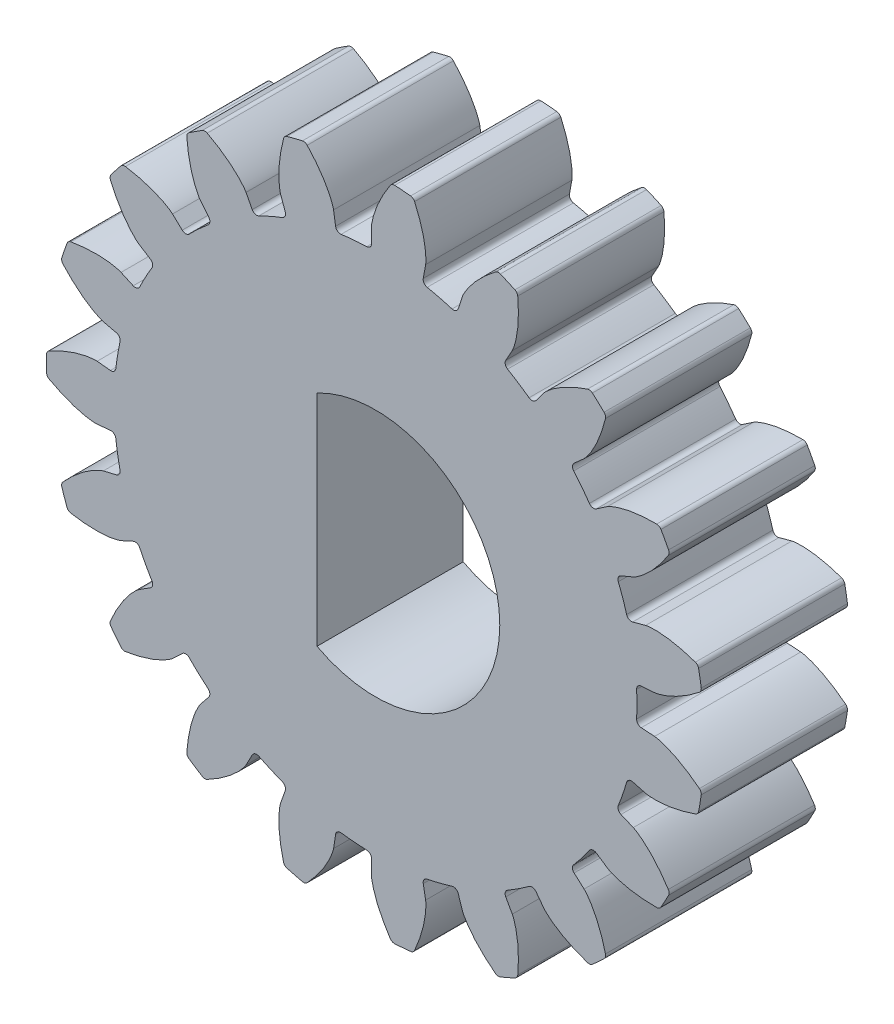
from build123d import *

# Parameters (mm, degrees)
SKETCH10_R                = 22.5
SKETCH10_R_2              = 1.25
BOSS_EXTRUDE5_DEPTH       = 10
CUT_EXTRUDE1_DEPTH        = 34.35416016
FILLET1_R                 = 0.34
CIRPATTERN1_COUNT         = 19
CIRPATTERN1_COPY_1_DEPTH  = 34.35416016
CIRPATTERN1_COPY_2_DEPTH  = 34.35416016
CIRPATTERN1_COPY_3_DEPTH  = 34.35416016
CIRPATTERN1_COPY_4_DEPTH  = 34.35416016
CIRPATTERN1_COPY_5_DEPTH  = 34.35416016
CIRPATTERN1_COPY_6_DEPTH  = 34.35416016
CIRPATTERN1_COPY_7_DEPTH  = 34.35416016
CIRPATTERN1_COPY_8_DEPTH  = 34.35416016
CIRPATTERN1_COPY_9_DEPTH  = 34.35416016
CIRPATTERN1_COPY_10_DEPTH = 34.35416016
CIRPATTERN1_COPY_11_DEPTH = 34.35416016
CIRPATTERN1_COPY_12_DEPTH = 34.35416016
CIRPATTERN1_COPY_13_DEPTH = 34.35416016
CIRPATTERN1_COPY_14_DEPTH = 34.35416016
CIRPATTERN1_COPY_15_DEPTH = 34.35416016
CIRPATTERN1_COPY_16_DEPTH = 34.35416016
CIRPATTERN1_COPY_17_DEPTH = 34.35416016
CIRPATTERN1_COPY_18_DEPTH = 34.35416016
FILLET1_OF_CIRPATTERN1_R  = 0.34
CUT_EXTRUDE2_DEPTH        = 34.328614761


with BuildPart() as part:
    # Sketch10 → Boss-Extrude5 (new body)
    with BuildSketch(Plane.XY):
        Circle(SKETCH10_R)
        Circle(SKETCH10_R_2, mode=Mode.SUBTRACT)
    extrude(amount=BOSS_EXTRUDE5_DEPTH)

    # Sketch11 → Cut-Extrude1 (cut, through all)
    with BuildSketch(Plane.XY.offset(10)):
        with BuildLine():
            Line((17.88, 0), (22.500466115, 0))
            ThreePointArc((22.500466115, 0), (22.451062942, 1.490217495), (22.303070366, 2.973890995))
            add(Edge.make_bspline(
                [(19.085941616, 1.295420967), (19.091347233, 1.295859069), (19.106491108, 1.297307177), (19.135048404, 1.300910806), (19.181520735, 1.308018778), (19.240530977, 1.318877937), (19.316536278, 1.334978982), (19.40569711, 1.356597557), (19.503249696, 1.383126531), (19.608873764, 1.414970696), (19.713766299, 1.449369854), (19.817921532, 1.486125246), (19.921223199, 1.524936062), (20.045785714, 1.574535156), (20.194335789, 1.637599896), (20.366697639, 1.716517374), (20.56061638, 1.812144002), (20.756460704, 1.916106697), (20.947660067, 2.023736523), (21.138990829, 2.138563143), (21.322794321, 2.253970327), (21.511680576, 2.380010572), (21.685008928, 2.499494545), (21.876829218, 2.640122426), (22.030947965, 2.755590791), (22.188094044, 2.880463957), (22.264270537, 2.942063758), (22.303070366, 2.973890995)],
                knots=[0, 0, 0, 0, 0, 0.005376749, 0.015083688, 0.02853182, 0.04661014, 0.064854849, 0.092110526, 0.119476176, 0.146842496, 0.174208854, 0.201574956, 0.228941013, 0.256307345, 0.307035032, 0.361767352, 0.416499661, 0.471231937, 0.525964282, 0.580696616, 0.635428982, 0.690161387, 0.744893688, 0.799626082, 0.854358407, 0.909090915, 0.909090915, 0.909090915, 0.909090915, 0.909090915], degree=4))
            Line((19.085941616, 1.295420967), (17.838957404, 1.210784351))
            ThreePointArc((17.838957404, 1.210784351), (17.869736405, 0.605739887), (17.88, 0))
        make_face()
    cut_extrude1 = extrude(amount=-CUT_EXTRUDE1_DEPTH, mode=Mode.SUBTRACT)

    # Mirror1: Cut-Extrude1 across plane
    add(cut_extrude1.mirror(Plane(origin=(17.88, 0, 0), x_dir=(0, 0, 1), z_dir=(0, -1, 0))), mode=Mode.SUBTRACT)

    # Fillet1
    fillet1_edges = [part.edges().sort_by_distance(p)[0] for p in [
        (17.838957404, -1.210784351, 5),
        (22.302646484, -2.973543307, 5),
        (22.302646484, 2.973543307, 5),
        (17.838957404, 1.210784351, 5),
    ]]
    fillet(fillet1_edges, radius=FILLET1_R)

    # CirPattern1: Cut-Extrude1 ×19 about axis
    cirpattern1_axis = Axis((0, 0, 10), (0, 0, -1))
    for i in range(1, CIRPATTERN1_COUNT):
        add(cut_extrude1.rotate(cirpattern1_axis, i * 360 / CIRPATTERN1_COUNT), mode=Mode.SUBTRACT)

    # CirPattern1 copy 1 sketch → CirPattern1 copy 1 (cut, through all)
    with BuildSketch(Plane(origin=(0, 0, 10), x_dir=(0.9458172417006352, -0.3246994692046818, 0), z_dir=(0, 0, 1))):
        with BuildLine():
            Line((17.88, 0), (22.500466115, 0))
            ThreePointArc((22.500466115, 0), (22.451062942, -1.490217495), (22.303070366, -2.973890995))
            add(Edge.make_bspline(
                [(19.085941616, -1.295420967), (19.091347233, -1.295859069), (19.106491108, -1.297307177), (19.135048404, -1.300910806), (19.181520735, -1.308018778), (19.240530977, -1.318877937), (19.316536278, -1.334978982), (19.40569711, -1.356597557), (19.503249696, -1.383126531), (19.608873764, -1.414970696), (19.713766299, -1.449369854), (19.817921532, -1.486125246), (19.921223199, -1.524936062), (20.045785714, -1.574535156), (20.194335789, -1.637599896), (20.366697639, -1.716517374), (20.56061638, -1.812144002), (20.756460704, -1.916106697), (20.947660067, -2.023736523), (21.138990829, -2.138563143), (21.322794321, -2.253970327), (21.511680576, -2.380010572), (21.685008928, -2.499494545), (21.876829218, -2.640122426), (22.030947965, -2.755590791), (22.188094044, -2.880463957), (22.264270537, -2.942063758), (22.303070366, -2.973890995)],
                knots=[0, 0, 0, 0, 0, 0.005376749, 0.015083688, 0.02853182, 0.04661014, 0.064854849, 0.092110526, 0.119476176, 0.146842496, 0.174208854, 0.201574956, 0.228941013, 0.256307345, 0.307035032, 0.361767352, 0.416499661, 0.471231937, 0.525964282, 0.580696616, 0.635428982, 0.690161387, 0.744893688, 0.799626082, 0.854358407, 0.909090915, 0.909090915, 0.909090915, 0.909090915, 0.909090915], degree=4))
            Line((19.085941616, -1.295420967), (17.838957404, -1.210784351))
            ThreePointArc((17.838957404, -1.210784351), (17.869736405, -0.605739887), (17.88, 0))
        make_face()
    extrude(amount=-CIRPATTERN1_COPY_1_DEPTH, mode=Mode.SUBTRACT)

    # CirPattern1 copy 2 sketch → CirPattern1 copy 2 (cut, through all)
    with BuildSketch(Plane(origin=(0, 0, 10), x_dir=(0.7891405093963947, -0.6142127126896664, 0), z_dir=(0, 0, 1))):
        with BuildLine():
            Line((17.88, 0), (22.500466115, 0))
            ThreePointArc((22.500466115, 0), (22.451062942, -1.490217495), (22.303070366, -2.973890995))
            add(Edge.make_bspline(
                [(19.085941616, -1.295420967), (19.091347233, -1.295859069), (19.106491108, -1.297307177), (19.135048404, -1.300910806), (19.181520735, -1.308018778), (19.240530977, -1.318877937), (19.316536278, -1.334978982), (19.40569711, -1.356597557), (19.503249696, -1.383126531), (19.608873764, -1.414970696), (19.713766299, -1.449369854), (19.817921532, -1.486125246), (19.921223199, -1.524936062), (20.045785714, -1.574535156), (20.194335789, -1.637599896), (20.366697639, -1.716517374), (20.56061638, -1.812144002), (20.756460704, -1.916106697), (20.947660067, -2.023736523), (21.138990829, -2.138563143), (21.322794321, -2.253970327), (21.511680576, -2.380010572), (21.685008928, -2.499494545), (21.876829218, -2.640122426), (22.030947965, -2.755590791), (22.188094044, -2.880463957), (22.264270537, -2.942063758), (22.303070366, -2.973890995)],
                knots=[0, 0, 0, 0, 0, 0.005376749, 0.015083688, 0.02853182, 0.04661014, 0.064854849, 0.092110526, 0.119476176, 0.146842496, 0.174208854, 0.201574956, 0.228941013, 0.256307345, 0.307035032, 0.361767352, 0.416499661, 0.471231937, 0.525964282, 0.580696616, 0.635428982, 0.690161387, 0.744893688, 0.799626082, 0.854358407, 0.909090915, 0.909090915, 0.909090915, 0.909090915, 0.909090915], degree=4))
            Line((19.085941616, -1.295420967), (17.838957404, -1.210784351))
            ThreePointArc((17.838957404, -1.210784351), (17.869736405, -0.605739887), (17.88, 0))
        make_face()
    extrude(amount=-CIRPATTERN1_COPY_2_DEPTH, mode=Mode.SUBTRACT)

    # CirPattern1 copy 3 sketch → CirPattern1 copy 3 (cut, through all)
    with BuildSketch(Plane(origin=(0, 0, 10), x_dir=(0.5469481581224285, -0.8371664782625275, 0), z_dir=(0, 0, 1))):
        with BuildLine():
            Line((17.88, 0), (22.500466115, 0))
            ThreePointArc((22.500466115, 0), (22.451062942, -1.490217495), (22.303070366, -2.973890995))
            add(Edge.make_bspline(
                [(19.085941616, -1.295420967), (19.091347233, -1.295859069), (19.106491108, -1.297307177), (19.135048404, -1.300910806), (19.181520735, -1.308018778), (19.240530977, -1.318877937), (19.316536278, -1.334978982), (19.40569711, -1.356597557), (19.503249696, -1.383126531), (19.608873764, -1.414970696), (19.713766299, -1.449369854), (19.817921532, -1.486125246), (19.921223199, -1.524936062), (20.045785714, -1.574535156), (20.194335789, -1.637599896), (20.366697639, -1.716517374), (20.56061638, -1.812144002), (20.756460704, -1.916106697), (20.947660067, -2.023736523), (21.138990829, -2.138563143), (21.322794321, -2.253970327), (21.511680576, -2.380010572), (21.685008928, -2.499494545), (21.876829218, -2.640122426), (22.030947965, -2.755590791), (22.188094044, -2.880463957), (22.264270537, -2.942063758), (22.303070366, -2.973890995)],
                knots=[0, 0, 0, 0, 0, 0.005376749, 0.015083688, 0.02853182, 0.04661014, 0.064854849, 0.092110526, 0.119476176, 0.146842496, 0.174208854, 0.201574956, 0.228941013, 0.256307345, 0.307035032, 0.361767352, 0.416499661, 0.471231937, 0.525964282, 0.580696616, 0.635428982, 0.690161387, 0.744893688, 0.799626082, 0.854358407, 0.909090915, 0.909090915, 0.909090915, 0.909090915, 0.909090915], degree=4))
            Line((19.085941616, -1.295420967), (17.838957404, -1.210784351))
            ThreePointArc((17.838957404, -1.210784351), (17.869736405, -0.605739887), (17.88, 0))
        make_face()
    extrude(amount=-CIRPATTERN1_COPY_3_DEPTH, mode=Mode.SUBTRACT)

    # CirPattern1 copy 4 sketch → CirPattern1 copy 4 (cut, through all)
    with BuildSketch(Plane(origin=(0, 0, 10), x_dir=(0.24548548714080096, -0.9694002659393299, 0), z_dir=(0, 0, 1))):
        with BuildLine():
            Line((17.88, 0), (22.500466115, 0))
            ThreePointArc((22.500466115, 0), (22.451062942, -1.490217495), (22.303070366, -2.973890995))
            add(Edge.make_bspline(
                [(19.085941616, -1.295420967), (19.091347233, -1.295859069), (19.106491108, -1.297307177), (19.135048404, -1.300910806), (19.181520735, -1.308018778), (19.240530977, -1.318877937), (19.316536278, -1.334978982), (19.40569711, -1.356597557), (19.503249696, -1.383126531), (19.608873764, -1.414970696), (19.713766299, -1.449369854), (19.817921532, -1.486125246), (19.921223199, -1.524936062), (20.045785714, -1.574535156), (20.194335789, -1.637599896), (20.366697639, -1.716517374), (20.56061638, -1.812144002), (20.756460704, -1.916106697), (20.947660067, -2.023736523), (21.138990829, -2.138563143), (21.322794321, -2.253970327), (21.511680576, -2.380010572), (21.685008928, -2.499494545), (21.876829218, -2.640122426), (22.030947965, -2.755590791), (22.188094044, -2.880463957), (22.264270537, -2.942063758), (22.303070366, -2.973890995)],
                knots=[0, 0, 0, 0, 0, 0.005376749, 0.015083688, 0.02853182, 0.04661014, 0.064854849, 0.092110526, 0.119476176, 0.146842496, 0.174208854, 0.201574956, 0.228941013, 0.256307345, 0.307035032, 0.361767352, 0.416499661, 0.471231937, 0.525964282, 0.580696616, 0.635428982, 0.690161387, 0.744893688, 0.799626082, 0.854358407, 0.909090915, 0.909090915, 0.909090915, 0.909090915, 0.909090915], degree=4))
            Line((19.085941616, -1.295420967), (17.838957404, -1.210784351))
            ThreePointArc((17.838957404, -1.210784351), (17.869736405, -0.605739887), (17.88, 0))
        make_face()
    extrude(amount=-CIRPATTERN1_COPY_4_DEPTH, mode=Mode.SUBTRACT)

    # CirPattern1 copy 5 sketch → CirPattern1 copy 5 (cut, through all)
    with BuildSketch(Plane(origin=(0, 0, 10), x_dir=(-0.08257934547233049, -0.99658449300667, 0), z_dir=(0, 0, 1))):
        with BuildLine():
            Line((17.88, 0), (22.500466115, 0))
            ThreePointArc((22.500466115, 0), (22.451062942, -1.490217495), (22.303070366, -2.973890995))
            add(Edge.make_bspline(
                [(19.085941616, -1.295420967), (19.091347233, -1.295859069), (19.106491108, -1.297307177), (19.135048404, -1.300910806), (19.181520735, -1.308018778), (19.240530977, -1.318877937), (19.316536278, -1.334978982), (19.40569711, -1.356597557), (19.503249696, -1.383126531), (19.608873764, -1.414970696), (19.713766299, -1.449369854), (19.817921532, -1.486125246), (19.921223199, -1.524936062), (20.045785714, -1.574535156), (20.194335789, -1.637599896), (20.366697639, -1.716517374), (20.56061638, -1.812144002), (20.756460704, -1.916106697), (20.947660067, -2.023736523), (21.138990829, -2.138563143), (21.322794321, -2.253970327), (21.511680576, -2.380010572), (21.685008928, -2.499494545), (21.876829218, -2.640122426), (22.030947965, -2.755590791), (22.188094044, -2.880463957), (22.264270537, -2.942063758), (22.303070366, -2.973890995)],
                knots=[0, 0, 0, 0, 0, 0.005376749, 0.015083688, 0.02853182, 0.04661014, 0.064854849, 0.092110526, 0.119476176, 0.146842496, 0.174208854, 0.201574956, 0.228941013, 0.256307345, 0.307035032, 0.361767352, 0.416499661, 0.471231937, 0.525964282, 0.580696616, 0.635428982, 0.690161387, 0.744893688, 0.799626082, 0.854358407, 0.909090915, 0.909090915, 0.909090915, 0.909090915, 0.909090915], degree=4))
            Line((19.085941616, -1.295420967), (17.838957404, -1.210784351))
            ThreePointArc((17.838957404, -1.210784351), (17.869736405, -0.605739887), (17.88, 0))
        make_face()
    extrude(amount=-CIRPATTERN1_COPY_5_DEPTH, mode=Mode.SUBTRACT)

    # CirPattern1 copy 6 sketch → CirPattern1 copy 6 (cut, through all)
    with BuildSketch(Plane(origin=(0, 0, 10), x_dir=(-0.4016954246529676, -0.9157733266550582, 0), z_dir=(0, 0, 1))):
        with BuildLine():
            Line((17.88, 0), (22.500466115, 0))
            ThreePointArc((22.500466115, 0), (22.451062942, -1.490217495), (22.303070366, -2.973890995))
            add(Edge.make_bspline(
                [(19.085941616, -1.295420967), (19.091347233, -1.295859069), (19.106491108, -1.297307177), (19.135048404, -1.300910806), (19.181520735, -1.308018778), (19.240530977, -1.318877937), (19.316536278, -1.334978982), (19.40569711, -1.356597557), (19.503249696, -1.383126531), (19.608873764, -1.414970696), (19.713766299, -1.449369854), (19.817921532, -1.486125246), (19.921223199, -1.524936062), (20.045785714, -1.574535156), (20.194335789, -1.637599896), (20.366697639, -1.716517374), (20.56061638, -1.812144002), (20.756460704, -1.916106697), (20.947660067, -2.023736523), (21.138990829, -2.138563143), (21.322794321, -2.253970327), (21.511680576, -2.380010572), (21.685008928, -2.499494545), (21.876829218, -2.640122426), (22.030947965, -2.755590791), (22.188094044, -2.880463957), (22.264270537, -2.942063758), (22.303070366, -2.973890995)],
                knots=[0, 0, 0, 0, 0, 0.005376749, 0.015083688, 0.02853182, 0.04661014, 0.064854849, 0.092110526, 0.119476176, 0.146842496, 0.174208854, 0.201574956, 0.228941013, 0.256307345, 0.307035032, 0.361767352, 0.416499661, 0.471231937, 0.525964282, 0.580696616, 0.635428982, 0.690161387, 0.744893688, 0.799626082, 0.854358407, 0.909090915, 0.909090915, 0.909090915, 0.909090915, 0.909090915], degree=4))
            Line((19.085941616, -1.295420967), (17.838957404, -1.210784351))
            ThreePointArc((17.838957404, -1.210784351), (17.869736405, -0.605739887), (17.88, 0))
        make_face()
    extrude(amount=-CIRPATTERN1_COPY_6_DEPTH, mode=Mode.SUBTRACT)

    # CirPattern1 copy 7 sketch → CirPattern1 copy 7 (cut, through all)
    with BuildSketch(Plane(origin=(0, 0, 10), x_dir=(-0.6772815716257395, -0.735723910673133, 0), z_dir=(0, 0, 1))):
        with BuildLine():
            Line((17.88, 0), (22.500466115, 0))
            ThreePointArc((22.500466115, 0), (22.451062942, -1.490217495), (22.303070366, -2.973890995))
            add(Edge.make_bspline(
                [(19.085941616, -1.295420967), (19.091347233, -1.295859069), (19.106491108, -1.297307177), (19.135048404, -1.300910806), (19.181520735, -1.308018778), (19.240530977, -1.318877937), (19.316536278, -1.334978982), (19.40569711, -1.356597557), (19.503249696, -1.383126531), (19.608873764, -1.414970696), (19.713766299, -1.449369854), (19.817921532, -1.486125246), (19.921223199, -1.524936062), (20.045785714, -1.574535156), (20.194335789, -1.637599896), (20.366697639, -1.716517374), (20.56061638, -1.812144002), (20.756460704, -1.916106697), (20.947660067, -2.023736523), (21.138990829, -2.138563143), (21.322794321, -2.253970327), (21.511680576, -2.380010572), (21.685008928, -2.499494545), (21.876829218, -2.640122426), (22.030947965, -2.755590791), (22.188094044, -2.880463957), (22.264270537, -2.942063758), (22.303070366, -2.973890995)],
                knots=[0, 0, 0, 0, 0, 0.005376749, 0.015083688, 0.02853182, 0.04661014, 0.064854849, 0.092110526, 0.119476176, 0.146842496, 0.174208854, 0.201574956, 0.228941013, 0.256307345, 0.307035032, 0.361767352, 0.416499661, 0.471231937, 0.525964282, 0.580696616, 0.635428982, 0.690161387, 0.744893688, 0.799626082, 0.854358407, 0.909090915, 0.909090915, 0.909090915, 0.909090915, 0.909090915], degree=4))
            Line((19.085941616, -1.295420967), (17.838957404, -1.210784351))
            ThreePointArc((17.838957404, -1.210784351), (17.869736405, -0.605739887), (17.88, 0))
        make_face()
    extrude(amount=-CIRPATTERN1_COPY_7_DEPTH, mode=Mode.SUBTRACT)

    # CirPattern1 copy 8 sketch → CirPattern1 copy 8 (cut, through all)
    with BuildSketch(Plane(origin=(0, 0, 10), x_dir=(-0.8794737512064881, -0.47594739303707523, 0), z_dir=(0, 0, 1))):
        with BuildLine():
            Line((17.88, 0), (22.500466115, 0))
            ThreePointArc((22.500466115, 0), (22.451062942, -1.490217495), (22.303070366, -2.973890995))
            add(Edge.make_bspline(
                [(19.085941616, -1.295420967), (19.091347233, -1.295859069), (19.106491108, -1.297307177), (19.135048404, -1.300910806), (19.181520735, -1.308018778), (19.240530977, -1.318877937), (19.316536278, -1.334978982), (19.40569711, -1.356597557), (19.503249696, -1.383126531), (19.608873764, -1.414970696), (19.713766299, -1.449369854), (19.817921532, -1.486125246), (19.921223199, -1.524936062), (20.045785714, -1.574535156), (20.194335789, -1.637599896), (20.366697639, -1.716517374), (20.56061638, -1.812144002), (20.756460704, -1.916106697), (20.947660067, -2.023736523), (21.138990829, -2.138563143), (21.322794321, -2.253970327), (21.511680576, -2.380010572), (21.685008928, -2.499494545), (21.876829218, -2.640122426), (22.030947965, -2.755590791), (22.188094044, -2.880463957), (22.264270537, -2.942063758), (22.303070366, -2.973890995)],
                knots=[0, 0, 0, 0, 0, 0.005376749, 0.015083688, 0.02853182, 0.04661014, 0.064854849, 0.092110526, 0.119476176, 0.146842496, 0.174208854, 0.201574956, 0.228941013, 0.256307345, 0.307035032, 0.361767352, 0.416499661, 0.471231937, 0.525964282, 0.580696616, 0.635428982, 0.690161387, 0.744893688, 0.799626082, 0.854358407, 0.909090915, 0.909090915, 0.909090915, 0.909090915, 0.909090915], degree=4))
            Line((19.085941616, -1.295420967), (17.838957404, -1.210784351))
            ThreePointArc((17.838957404, -1.210784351), (17.869736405, -0.605739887), (17.88, 0))
        make_face()
    extrude(amount=-CIRPATTERN1_COPY_8_DEPTH, mode=Mode.SUBTRACT)

    # CirPattern1 copy 9 sketch → CirPattern1 copy 9 (cut, through all)
    with BuildSketch(Plane(origin=(0, 0, 10), x_dir=(-0.986361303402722, -0.1645945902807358, 0), z_dir=(0, 0, 1))):
        with BuildLine():
            Line((17.88, 0), (22.500466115, 0))
            ThreePointArc((22.500466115, 0), (22.451062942, -1.490217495), (22.303070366, -2.973890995))
            add(Edge.make_bspline(
                [(19.085941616, -1.295420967), (19.091347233, -1.295859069), (19.106491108, -1.297307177), (19.135048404, -1.300910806), (19.181520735, -1.308018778), (19.240530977, -1.318877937), (19.316536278, -1.334978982), (19.40569711, -1.356597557), (19.503249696, -1.383126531), (19.608873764, -1.414970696), (19.713766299, -1.449369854), (19.817921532, -1.486125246), (19.921223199, -1.524936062), (20.045785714, -1.574535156), (20.194335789, -1.637599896), (20.366697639, -1.716517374), (20.56061638, -1.812144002), (20.756460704, -1.916106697), (20.947660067, -2.023736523), (21.138990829, -2.138563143), (21.322794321, -2.253970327), (21.511680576, -2.380010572), (21.685008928, -2.499494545), (21.876829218, -2.640122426), (22.030947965, -2.755590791), (22.188094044, -2.880463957), (22.264270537, -2.942063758), (22.303070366, -2.973890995)],
                knots=[0, 0, 0, 0, 0, 0.005376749, 0.015083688, 0.02853182, 0.04661014, 0.064854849, 0.092110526, 0.119476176, 0.146842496, 0.174208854, 0.201574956, 0.228941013, 0.256307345, 0.307035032, 0.361767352, 0.416499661, 0.471231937, 0.525964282, 0.580696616, 0.635428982, 0.690161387, 0.744893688, 0.799626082, 0.854358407, 0.909090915, 0.909090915, 0.909090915, 0.909090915, 0.909090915], degree=4))
            Line((19.085941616, -1.295420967), (17.838957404, -1.210784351))
            ThreePointArc((17.838957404, -1.210784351), (17.869736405, -0.605739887), (17.88, 0))
        make_face()
    extrude(amount=-CIRPATTERN1_COPY_9_DEPTH, mode=Mode.SUBTRACT)

    # CirPattern1 copy 10 sketch → CirPattern1 copy 10 (cut, through all)
    with BuildSketch(Plane(origin=(0, 0, 10), x_dir=(-0.9863613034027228, 0.164594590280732, 0), z_dir=(0, 0, 1))):
        with BuildLine():
            Line((17.88, 0), (22.500466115, 0))
            ThreePointArc((22.500466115, 0), (22.451062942, -1.490217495), (22.303070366, -2.973890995))
            add(Edge.make_bspline(
                [(19.085941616, -1.295420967), (19.091347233, -1.295859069), (19.106491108, -1.297307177), (19.135048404, -1.300910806), (19.181520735, -1.308018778), (19.240530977, -1.318877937), (19.316536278, -1.334978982), (19.40569711, -1.356597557), (19.503249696, -1.383126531), (19.608873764, -1.414970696), (19.713766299, -1.449369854), (19.817921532, -1.486125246), (19.921223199, -1.524936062), (20.045785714, -1.574535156), (20.194335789, -1.637599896), (20.366697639, -1.716517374), (20.56061638, -1.812144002), (20.756460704, -1.916106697), (20.947660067, -2.023736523), (21.138990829, -2.138563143), (21.322794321, -2.253970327), (21.511680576, -2.380010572), (21.685008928, -2.499494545), (21.876829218, -2.640122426), (22.030947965, -2.755590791), (22.188094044, -2.880463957), (22.264270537, -2.942063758), (22.303070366, -2.973890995)],
                knots=[0, 0, 0, 0, 0, 0.005376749, 0.015083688, 0.02853182, 0.04661014, 0.064854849, 0.092110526, 0.119476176, 0.146842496, 0.174208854, 0.201574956, 0.228941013, 0.256307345, 0.307035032, 0.361767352, 0.416499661, 0.471231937, 0.525964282, 0.580696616, 0.635428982, 0.690161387, 0.744893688, 0.799626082, 0.854358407, 0.909090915, 0.909090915, 0.909090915, 0.909090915, 0.909090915], degree=4))
            Line((19.085941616, -1.295420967), (17.838957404, -1.210784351))
            ThreePointArc((17.838957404, -1.210784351), (17.869736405, -0.605739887), (17.88, 0))
        make_face()
    extrude(amount=-CIRPATTERN1_COPY_10_DEPTH, mode=Mode.SUBTRACT)

    # CirPattern1 copy 11 sketch → CirPattern1 copy 11 (cut, through all)
    with BuildSketch(Plane(origin=(0, 0, 10), x_dir=(-0.8794737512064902, 0.47594739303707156, 0), z_dir=(0, 0, 1))):
        with BuildLine():
            Line((17.88, 0), (22.500466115, 0))
            ThreePointArc((22.500466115, 0), (22.451062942, -1.490217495), (22.303070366, -2.973890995))
            add(Edge.make_bspline(
                [(19.085941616, -1.295420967), (19.091347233, -1.295859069), (19.106491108, -1.297307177), (19.135048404, -1.300910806), (19.181520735, -1.308018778), (19.240530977, -1.318877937), (19.316536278, -1.334978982), (19.40569711, -1.356597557), (19.503249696, -1.383126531), (19.608873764, -1.414970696), (19.713766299, -1.449369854), (19.817921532, -1.486125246), (19.921223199, -1.524936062), (20.045785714, -1.574535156), (20.194335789, -1.637599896), (20.366697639, -1.716517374), (20.56061638, -1.812144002), (20.756460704, -1.916106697), (20.947660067, -2.023736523), (21.138990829, -2.138563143), (21.322794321, -2.253970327), (21.511680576, -2.380010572), (21.685008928, -2.499494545), (21.876829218, -2.640122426), (22.030947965, -2.755590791), (22.188094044, -2.880463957), (22.264270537, -2.942063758), (22.303070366, -2.973890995)],
                knots=[0, 0, 0, 0, 0, 0.005376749, 0.015083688, 0.02853182, 0.04661014, 0.064854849, 0.092110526, 0.119476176, 0.146842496, 0.174208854, 0.201574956, 0.228941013, 0.256307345, 0.307035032, 0.361767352, 0.416499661, 0.471231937, 0.525964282, 0.580696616, 0.635428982, 0.690161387, 0.744893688, 0.799626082, 0.854358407, 0.909090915, 0.909090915, 0.909090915, 0.909090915, 0.909090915], degree=4))
            Line((19.085941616, -1.295420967), (17.838957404, -1.210784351))
            ThreePointArc((17.838957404, -1.210784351), (17.869736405, -0.605739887), (17.88, 0))
        make_face()
    extrude(amount=-CIRPATTERN1_COPY_11_DEPTH, mode=Mode.SUBTRACT)

    # CirPattern1 copy 12 sketch → CirPattern1 copy 12 (cut, through all)
    with BuildSketch(Plane(origin=(0, 0, 10), x_dir=(-0.6772815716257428, 0.73572391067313, 0), z_dir=(0, 0, 1))):
        with BuildLine():
            Line((17.88, 0), (22.500466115, 0))
            ThreePointArc((22.500466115, 0), (22.451062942, -1.490217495), (22.303070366, -2.973890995))
            add(Edge.make_bspline(
                [(19.085941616, -1.295420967), (19.091347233, -1.295859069), (19.106491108, -1.297307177), (19.135048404, -1.300910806), (19.181520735, -1.308018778), (19.240530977, -1.318877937), (19.316536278, -1.334978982), (19.40569711, -1.356597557), (19.503249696, -1.383126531), (19.608873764, -1.414970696), (19.713766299, -1.449369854), (19.817921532, -1.486125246), (19.921223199, -1.524936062), (20.045785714, -1.574535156), (20.194335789, -1.637599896), (20.366697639, -1.716517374), (20.56061638, -1.812144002), (20.756460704, -1.916106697), (20.947660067, -2.023736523), (21.138990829, -2.138563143), (21.322794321, -2.253970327), (21.511680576, -2.380010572), (21.685008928, -2.499494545), (21.876829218, -2.640122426), (22.030947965, -2.755590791), (22.188094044, -2.880463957), (22.264270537, -2.942063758), (22.303070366, -2.973890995)],
                knots=[0, 0, 0, 0, 0, 0.005376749, 0.015083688, 0.02853182, 0.04661014, 0.064854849, 0.092110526, 0.119476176, 0.146842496, 0.174208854, 0.201574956, 0.228941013, 0.256307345, 0.307035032, 0.361767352, 0.416499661, 0.471231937, 0.525964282, 0.580696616, 0.635428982, 0.690161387, 0.744893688, 0.799626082, 0.854358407, 0.909090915, 0.909090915, 0.909090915, 0.909090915, 0.909090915], degree=4))
            Line((19.085941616, -1.295420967), (17.838957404, -1.210784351))
            ThreePointArc((17.838957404, -1.210784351), (17.869736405, -0.605739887), (17.88, 0))
        make_face()
    extrude(amount=-CIRPATTERN1_COPY_12_DEPTH, mode=Mode.SUBTRACT)

    # CirPattern1 copy 13 sketch → CirPattern1 copy 13 (cut, through all)
    with BuildSketch(Plane(origin=(0, 0, 10), x_dir=(-0.40169542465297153, 0.9157733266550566, 0), z_dir=(0, 0, 1))):
        with BuildLine():
            Line((17.88, 0), (22.500466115, 0))
            ThreePointArc((22.500466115, 0), (22.451062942, -1.490217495), (22.303070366, -2.973890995))
            add(Edge.make_bspline(
                [(19.085941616, -1.295420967), (19.091347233, -1.295859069), (19.106491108, -1.297307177), (19.135048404, -1.300910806), (19.181520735, -1.308018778), (19.240530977, -1.318877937), (19.316536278, -1.334978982), (19.40569711, -1.356597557), (19.503249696, -1.383126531), (19.608873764, -1.414970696), (19.713766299, -1.449369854), (19.817921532, -1.486125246), (19.921223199, -1.524936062), (20.045785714, -1.574535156), (20.194335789, -1.637599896), (20.366697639, -1.716517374), (20.56061638, -1.812144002), (20.756460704, -1.916106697), (20.947660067, -2.023736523), (21.138990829, -2.138563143), (21.322794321, -2.253970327), (21.511680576, -2.380010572), (21.685008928, -2.499494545), (21.876829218, -2.640122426), (22.030947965, -2.755590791), (22.188094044, -2.880463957), (22.264270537, -2.942063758), (22.303070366, -2.973890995)],
                knots=[0, 0, 0, 0, 0, 0.005376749, 0.015083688, 0.02853182, 0.04661014, 0.064854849, 0.092110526, 0.119476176, 0.146842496, 0.174208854, 0.201574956, 0.228941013, 0.256307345, 0.307035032, 0.361767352, 0.416499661, 0.471231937, 0.525964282, 0.580696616, 0.635428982, 0.690161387, 0.744893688, 0.799626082, 0.854358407, 0.909090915, 0.909090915, 0.909090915, 0.909090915, 0.909090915], degree=4))
            Line((19.085941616, -1.295420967), (17.838957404, -1.210784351))
            ThreePointArc((17.838957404, -1.210784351), (17.869736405, -0.605739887), (17.88, 0))
        make_face()
    extrude(amount=-CIRPATTERN1_COPY_13_DEPTH, mode=Mode.SUBTRACT)

    # CirPattern1 copy 14 sketch → CirPattern1 copy 14 (cut, through all)
    with BuildSketch(Plane(origin=(0, 0, 10), x_dir=(-0.08257934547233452, 0.9965844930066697, 0), z_dir=(0, 0, 1))):
        with BuildLine():
            Line((17.88, 0), (22.500466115, 0))
            ThreePointArc((22.500466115, 0), (22.451062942, -1.490217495), (22.303070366, -2.973890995))
            add(Edge.make_bspline(
                [(19.085941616, -1.295420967), (19.091347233, -1.295859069), (19.106491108, -1.297307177), (19.135048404, -1.300910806), (19.181520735, -1.308018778), (19.240530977, -1.318877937), (19.316536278, -1.334978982), (19.40569711, -1.356597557), (19.503249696, -1.383126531), (19.608873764, -1.414970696), (19.713766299, -1.449369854), (19.817921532, -1.486125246), (19.921223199, -1.524936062), (20.045785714, -1.574535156), (20.194335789, -1.637599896), (20.366697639, -1.716517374), (20.56061638, -1.812144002), (20.756460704, -1.916106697), (20.947660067, -2.023736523), (21.138990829, -2.138563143), (21.322794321, -2.253970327), (21.511680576, -2.380010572), (21.685008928, -2.499494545), (21.876829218, -2.640122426), (22.030947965, -2.755590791), (22.188094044, -2.880463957), (22.264270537, -2.942063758), (22.303070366, -2.973890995)],
                knots=[0, 0, 0, 0, 0, 0.005376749, 0.015083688, 0.02853182, 0.04661014, 0.064854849, 0.092110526, 0.119476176, 0.146842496, 0.174208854, 0.201574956, 0.228941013, 0.256307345, 0.307035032, 0.361767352, 0.416499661, 0.471231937, 0.525964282, 0.580696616, 0.635428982, 0.690161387, 0.744893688, 0.799626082, 0.854358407, 0.909090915, 0.909090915, 0.909090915, 0.909090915, 0.909090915], degree=4))
            Line((19.085941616, -1.295420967), (17.838957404, -1.210784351))
            ThreePointArc((17.838957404, -1.210784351), (17.869736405, -0.605739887), (17.88, 0))
        make_face()
    extrude(amount=-CIRPATTERN1_COPY_14_DEPTH, mode=Mode.SUBTRACT)

    # CirPattern1 copy 15 sketch → CirPattern1 copy 15 (cut, through all)
    with BuildSketch(Plane(origin=(0, 0, 10), x_dir=(0.24548548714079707, 0.9694002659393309, 0), z_dir=(0, 0, 1))):
        with BuildLine():
            Line((17.88, 0), (22.500466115, 0))
            ThreePointArc((22.500466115, 0), (22.451062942, -1.490217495), (22.303070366, -2.973890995))
            add(Edge.make_bspline(
                [(19.085941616, -1.295420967), (19.091347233, -1.295859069), (19.106491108, -1.297307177), (19.135048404, -1.300910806), (19.181520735, -1.308018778), (19.240530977, -1.318877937), (19.316536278, -1.334978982), (19.40569711, -1.356597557), (19.503249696, -1.383126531), (19.608873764, -1.414970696), (19.713766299, -1.449369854), (19.817921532, -1.486125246), (19.921223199, -1.524936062), (20.045785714, -1.574535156), (20.194335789, -1.637599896), (20.366697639, -1.716517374), (20.56061638, -1.812144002), (20.756460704, -1.916106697), (20.947660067, -2.023736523), (21.138990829, -2.138563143), (21.322794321, -2.253970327), (21.511680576, -2.380010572), (21.685008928, -2.499494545), (21.876829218, -2.640122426), (22.030947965, -2.755590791), (22.188094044, -2.880463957), (22.264270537, -2.942063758), (22.303070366, -2.973890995)],
                knots=[0, 0, 0, 0, 0, 0.005376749, 0.015083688, 0.02853182, 0.04661014, 0.064854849, 0.092110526, 0.119476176, 0.146842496, 0.174208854, 0.201574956, 0.228941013, 0.256307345, 0.307035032, 0.361767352, 0.416499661, 0.471231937, 0.525964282, 0.580696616, 0.635428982, 0.690161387, 0.744893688, 0.799626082, 0.854358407, 0.909090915, 0.909090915, 0.909090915, 0.909090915, 0.909090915], degree=4))
            Line((19.085941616, -1.295420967), (17.838957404, -1.210784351))
            ThreePointArc((17.838957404, -1.210784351), (17.869736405, -0.605739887), (17.88, 0))
        make_face()
    extrude(amount=-CIRPATTERN1_COPY_15_DEPTH, mode=Mode.SUBTRACT)

    # CirPattern1 copy 16 sketch → CirPattern1 copy 16 (cut, through all)
    with BuildSketch(Plane(origin=(0, 0, 10), x_dir=(0.5469481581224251, 0.8371664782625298, 0), z_dir=(0, 0, 1))):
        with BuildLine():
            Line((17.88, 0), (22.500466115, 0))
            ThreePointArc((22.500466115, 0), (22.451062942, -1.490217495), (22.303070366, -2.973890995))
            add(Edge.make_bspline(
                [(19.085941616, -1.295420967), (19.091347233, -1.295859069), (19.106491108, -1.297307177), (19.135048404, -1.300910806), (19.181520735, -1.308018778), (19.240530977, -1.318877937), (19.316536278, -1.334978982), (19.40569711, -1.356597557), (19.503249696, -1.383126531), (19.608873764, -1.414970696), (19.713766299, -1.449369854), (19.817921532, -1.486125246), (19.921223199, -1.524936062), (20.045785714, -1.574535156), (20.194335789, -1.637599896), (20.366697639, -1.716517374), (20.56061638, -1.812144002), (20.756460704, -1.916106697), (20.947660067, -2.023736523), (21.138990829, -2.138563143), (21.322794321, -2.253970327), (21.511680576, -2.380010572), (21.685008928, -2.499494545), (21.876829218, -2.640122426), (22.030947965, -2.755590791), (22.188094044, -2.880463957), (22.264270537, -2.942063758), (22.303070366, -2.973890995)],
                knots=[0, 0, 0, 0, 0, 0.005376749, 0.015083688, 0.02853182, 0.04661014, 0.064854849, 0.092110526, 0.119476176, 0.146842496, 0.174208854, 0.201574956, 0.228941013, 0.256307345, 0.307035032, 0.361767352, 0.416499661, 0.471231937, 0.525964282, 0.580696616, 0.635428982, 0.690161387, 0.744893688, 0.799626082, 0.854358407, 0.909090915, 0.909090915, 0.909090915, 0.909090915, 0.909090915], degree=4))
            Line((19.085941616, -1.295420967), (17.838957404, -1.210784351))
            ThreePointArc((17.838957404, -1.210784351), (17.869736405, -0.605739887), (17.88, 0))
        make_face()
    extrude(amount=-CIRPATTERN1_COPY_16_DEPTH, mode=Mode.SUBTRACT)

    # CirPattern1 copy 17 sketch → CirPattern1 copy 17 (cut, through all)
    with BuildSketch(Plane(origin=(0, 0, 10), x_dir=(0.7891405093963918, 0.6142127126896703, 0), z_dir=(0, 0, 1))):
        with BuildLine():
            Line((17.88, 0), (22.500466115, 0))
            ThreePointArc((22.500466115, 0), (22.451062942, -1.490217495), (22.303070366, -2.973890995))
            add(Edge.make_bspline(
                [(19.085941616, -1.295420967), (19.091347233, -1.295859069), (19.106491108, -1.297307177), (19.135048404, -1.300910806), (19.181520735, -1.308018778), (19.240530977, -1.318877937), (19.316536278, -1.334978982), (19.40569711, -1.356597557), (19.503249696, -1.383126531), (19.608873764, -1.414970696), (19.713766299, -1.449369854), (19.817921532, -1.486125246), (19.921223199, -1.524936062), (20.045785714, -1.574535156), (20.194335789, -1.637599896), (20.366697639, -1.716517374), (20.56061638, -1.812144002), (20.756460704, -1.916106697), (20.947660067, -2.023736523), (21.138990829, -2.138563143), (21.322794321, -2.253970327), (21.511680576, -2.380010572), (21.685008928, -2.499494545), (21.876829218, -2.640122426), (22.030947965, -2.755590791), (22.188094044, -2.880463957), (22.264270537, -2.942063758), (22.303070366, -2.973890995)],
                knots=[0, 0, 0, 0, 0, 0.005376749, 0.015083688, 0.02853182, 0.04661014, 0.064854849, 0.092110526, 0.119476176, 0.146842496, 0.174208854, 0.201574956, 0.228941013, 0.256307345, 0.307035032, 0.361767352, 0.416499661, 0.471231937, 0.525964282, 0.580696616, 0.635428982, 0.690161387, 0.744893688, 0.799626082, 0.854358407, 0.909090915, 0.909090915, 0.909090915, 0.909090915, 0.909090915], degree=4))
            Line((19.085941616, -1.295420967), (17.838957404, -1.210784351))
            ThreePointArc((17.838957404, -1.210784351), (17.869736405, -0.605739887), (17.88, 0))
        make_face()
    extrude(amount=-CIRPATTERN1_COPY_17_DEPTH, mode=Mode.SUBTRACT)

    # CirPattern1 copy 18 sketch → CirPattern1 copy 18 (cut, through all)
    with BuildSketch(Plane(origin=(0, 0, 10), x_dir=(0.9458172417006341, 0.3246994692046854, 0), z_dir=(0, 0, 1))):
        with BuildLine():
            Line((17.88, 0), (22.500466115, 0))
            ThreePointArc((22.500466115, 0), (22.451062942, -1.490217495), (22.303070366, -2.973890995))
            add(Edge.make_bspline(
                [(19.085941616, -1.295420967), (19.091347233, -1.295859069), (19.106491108, -1.297307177), (19.135048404, -1.300910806), (19.181520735, -1.308018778), (19.240530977, -1.318877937), (19.316536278, -1.334978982), (19.40569711, -1.356597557), (19.503249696, -1.383126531), (19.608873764, -1.414970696), (19.713766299, -1.449369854), (19.817921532, -1.486125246), (19.921223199, -1.524936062), (20.045785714, -1.574535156), (20.194335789, -1.637599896), (20.366697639, -1.716517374), (20.56061638, -1.812144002), (20.756460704, -1.916106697), (20.947660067, -2.023736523), (21.138990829, -2.138563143), (21.322794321, -2.253970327), (21.511680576, -2.380010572), (21.685008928, -2.499494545), (21.876829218, -2.640122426), (22.030947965, -2.755590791), (22.188094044, -2.880463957), (22.264270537, -2.942063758), (22.303070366, -2.973890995)],
                knots=[0, 0, 0, 0, 0, 0.005376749, 0.015083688, 0.02853182, 0.04661014, 0.064854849, 0.092110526, 0.119476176, 0.146842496, 0.174208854, 0.201574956, 0.228941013, 0.256307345, 0.307035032, 0.361767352, 0.416499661, 0.471231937, 0.525964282, 0.580696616, 0.635428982, 0.690161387, 0.744893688, 0.799626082, 0.854358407, 0.909090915, 0.909090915, 0.909090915, 0.909090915, 0.909090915], degree=4))
            Line((19.085941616, -1.295420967), (17.838957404, -1.210784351))
            ThreePointArc((17.838957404, -1.210784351), (17.869736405, -0.605739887), (17.88, 0))
        make_face()
    extrude(amount=-CIRPATTERN1_COPY_18_DEPTH, mode=Mode.SUBTRACT)

    # Fillet1 of CirPattern1
    fillet1_of_cirpattern1_edges = [part.edges().sort_by_distance(p)[0] for p in [
        (16.47925245, -6.937480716, 5),
        (20.128719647, -10.054086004, 5),
        (22.059735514, -4.429228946, 5),
        (17.265534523, -4.647119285, 5),
        (13.333764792, -11.912393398, 5),
        (15.773533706, -16.045112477, 5),
        (19.426309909, -11.352025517, 5),
        (14.821123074, -10.001435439, 5),
        (8.743356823, -15.596413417, 5),
        (9.709040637, -20.297402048, 5),
        (14.687742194, -17.044653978, 5),
        (10.770612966, -14.271940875, 5),
        (3.205470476, -17.590320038, 5),
        (2.592422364, -22.35015316, 5),
        (8.35752971, -20.890229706, 5),
        (5.552939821, -16.995860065, 5),
        (-2.679778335, -17.678042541, 5),
        (-4.805125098, -21.980918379, 5),
        (1.1216492, -22.472024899, 5),
        (-0.266480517, -17.878014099, 5),
        (-8.274631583, -15.850074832, 5),
        (-11.681962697, -19.229710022, 5),
        (-6.235779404, -21.618627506, 5),
        (-6.057023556, -16.8228079, 5),
        (-12.972800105, -12.304505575, 5),
        (-17.292878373, -14.394664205, 5),
        (-12.917464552, -18.422516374, 5),
        (-11.191194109, -13.944589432, 5),
        (-16.265164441, -7.425552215, 5),
        (-21.029842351, -7.999733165, 5),
        (-18.19934198, -13.230039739, 5),
        (-15.11262513, -9.555258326, 5),
        (-17.79494583, -1.741925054, 5),
        (-22.487896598, -0.737906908, 5),
        (-21.509038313, -6.603883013, 5),
        (-17.396368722, -4.130466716, 5),
        (-17.396368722, 4.130466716, 5),
        (-21.509038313, 6.603883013, 5),
        (-22.487896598, 0.737906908, 5),
        (-17.79494583, 1.741925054, 5),
        (-15.11262513, 9.555258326, 5),
        (-18.19934198, 13.230039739, 5),
        (-21.029842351, 7.999733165, 5),
        (-16.265164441, 7.425552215, 5),
        (-11.191194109, 13.944589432, 5),
        (-12.917464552, 18.422516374, 5),
        (-17.292878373, 14.394664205, 5),
        (-12.972800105, 12.304505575, 5),
        (-6.057023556, 16.8228079, 5),
        (-6.235779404, 21.618627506, 5),
        (-11.681962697, 19.229710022, 5),
        (-8.274631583, 15.850074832, 5),
        (-0.266480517, 17.878014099, 5),
        (1.1216492, 22.472024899, 5),
        (-4.805125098, 21.980918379, 5),
        (-2.679778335, 17.678042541, 5),
        (5.552939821, 16.995860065, 5),
        (8.35752971, 20.890229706, 5),
        (2.592422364, 22.35015316, 5),
        (3.205470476, 17.590320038, 5),
        (10.770612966, 14.271940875, 5),
        (14.687742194, 17.044653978, 5),
        (9.709040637, 20.297402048, 5),
        (8.743356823, 15.596413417, 5),
        (14.821123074, 10.001435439, 5),
        (19.426309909, 11.352025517, 5),
        (15.773533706, 16.045112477, 5),
        (13.333764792, 11.912393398, 5),
        (17.265534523, 4.647119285, 5),
        (22.059735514, 4.429228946, 5),
        (20.128719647, 10.054086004, 5),
        (16.47925245, 6.937480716, 5),
    ]]
    fillet(fillet1_of_cirpattern1_edges, radius=FILLET1_OF_CIRPATTERN1_R)

    # Sketch12 → Cut-Extrude2 (cut, through all)
    with BuildSketch(Plane.XY.offset(10)):
        with BuildLine():
            Line((-4, 0), (-4, 7.5))
            ThreePointArc((-4, 7.5), (8.5, 0), (-4, -7.5))
            Line((-4, -7.5), (-4, 0))
        make_face()
    extrude(amount=-CUT_EXTRUDE2_DEPTH, mode=Mode.SUBTRACT)


solid = part.part
